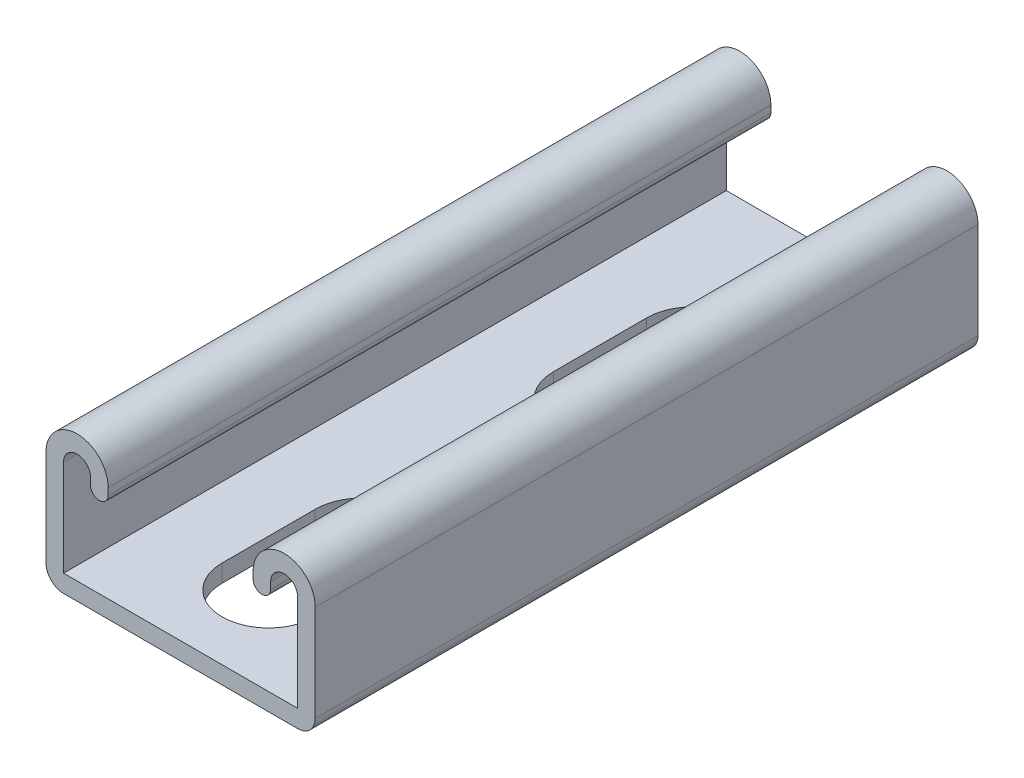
from build123d import *

# Parameters (mm, degrees)
BASE_EXTRUDE_DEPTH = 101.6
SLOT_DEPTH         = 123.149424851
LPATTERN1_COUNT    = 2
LPATTERN1_PITCH    = 50.8


with BuildPart() as part:
    # Sketch1 → Base-Extrude (new body)
    with BuildSketch(Plane.XY):
        with BuildLine():
            Line((-20.6375, 8.3693), (-20.6375, -6.4008))
            ThreePointArc((-20.6375, -6.4008), (-19.848914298, -8.304614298), (-17.9451, -9.0932))
            Line((-17.9451, -9.0932), (17.9451, -9.0932))
            ThreePointArc((17.9451, -9.0932), (19.848914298, -8.304614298), (20.6375, -6.4008))
            Line((20.6375, -6.4008), (20.6375, 8.3693))
            ThreePointArc((20.6375, 8.3693), (15.875, 13.1318), (11.1125, 8.3693))
            Line((11.1125, 8.3693), (11.1125, 7.33425))
            ThreePointArc((11.1125, 7.33425), (12.4587, 5.98805), (13.8049, 7.33425))
            Line((13.8049, 7.33425), (13.8049, 8.3693))
            ThreePointArc((13.8049, 8.3693), (15.875, 10.4394), (17.9451, 8.3693))
            Line((17.9451, 8.3693), (17.9451, -6.4008))
            Line((17.9451, -6.4008), (-17.9451, -6.4008))
            Line((-17.9451, -6.4008), (-17.9451, 8.3693))
            ThreePointArc((-17.9451, 8.3693), (-15.875, 10.4394), (-13.8049, 8.3693))
            Line((-13.8049, 8.3693), (-13.8049, 7.33425))
            ThreePointArc((-13.8049, 7.33425), (-12.4587, 5.98805), (-11.1125, 7.33425))
            Line((-11.1125, 7.33425), (-11.1125, 8.3693))
            ThreePointArc((-11.1125, 8.3693), (-15.875, 13.1318), (-20.6375, 8.3693))
        make_face()
    extrude(amount=BASE_EXTRUDE_DEPTH)

    # Sketch2 → Slot (cut, through all)
    with BuildSketch(Plane(origin=(0, -9.0932, -16.724236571), x_dir=(1, 0, 0), z_dir=(0, -1, 0))):
        with BuildLine():
            Line((7.14375, 54.030486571), (7.14375, 39.742986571))
            ThreePointArc((7.14375, 39.742986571), (0, 32.599236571), (-7.14375, 39.742986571))
            Line((-7.14375, 39.742986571), (-7.14375, 54.030486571))
            ThreePointArc((-7.14375, 54.030486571), (0, 61.174236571), (7.14375, 54.030486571))
        make_face()
    slot = extrude(amount=-SLOT_DEPTH, mode=Mode.SUBTRACT)

    # LPattern1: Slot ×2
    with Locations(*[(0, 0, i * LPATTERN1_PITCH) for i in range(1, LPATTERN1_COUNT)]):
        add(slot, mode=Mode.SUBTRACT)


solid = part.part
